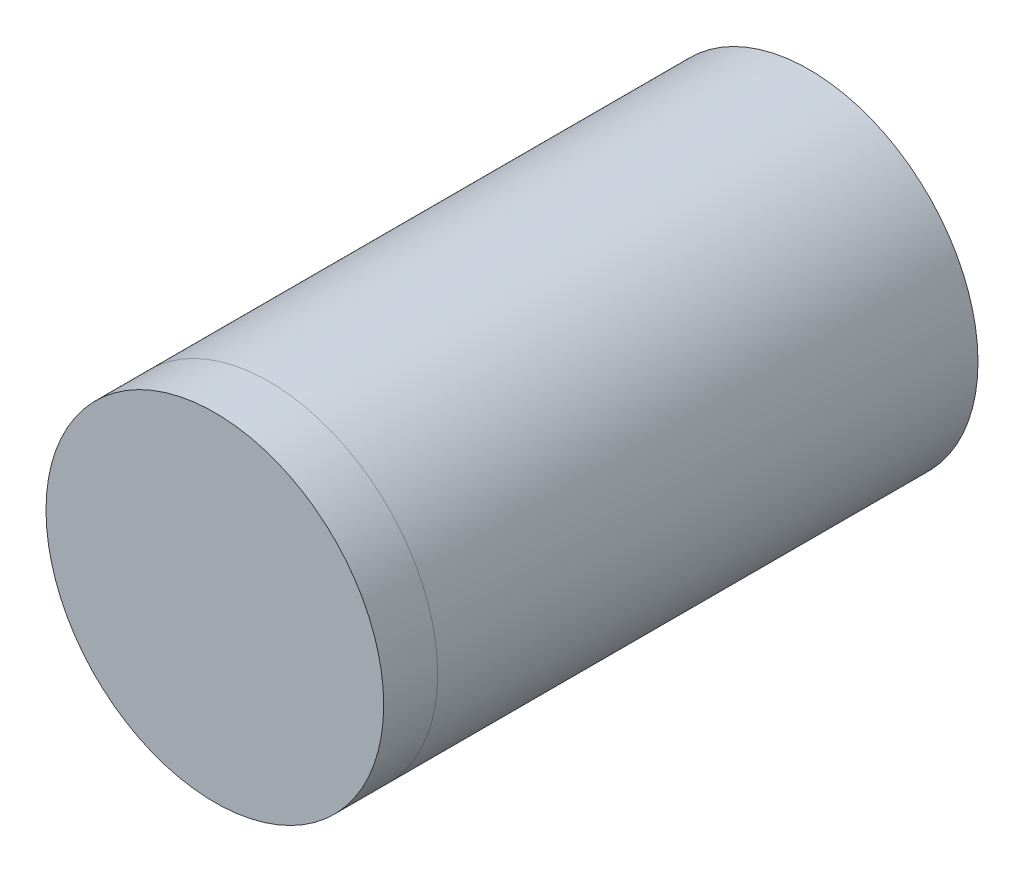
from build123d import *

# Parameters (mm, degrees)
ESQUISSECORPS_W = 10.0005
ESQUISSECORPS_H = 3.2
ESQUISSE1_W     = 10
ESQUISSE1_H     = 32


with BuildPart() as part:
    # EsquisseCorps → Base-R_volution (revolve)
    with BuildSketch(Plane(origin=(0, 0, 0), x_dir=(1, 0, 0), z_dir=(0, 1, 0)), mode=Mode.PRIVATE) as base_r_volution_sk:
        with Locations((5.00025, -33.599)):
            Rectangle(ESQUISSECORPS_W, ESQUISSECORPS_H)
    revolve(base_r_volution_sk.sketch.rotate(Axis((0, 0, 0), (0, 0, 1)), 180), axis=Axis((0, 0, 0), (0, 0, 1)))

    # Esquisse1 → Boss.-R_vol.1 (revolve)
    with BuildSketch(Plane(origin=(0, 0, 0), x_dir=(1, 0, 0), z_dir=(0, 1, 0)), mode=Mode.PRIVATE) as boss_r_vol_1_sk:
        with Locations((5, -15.999)):
            Rectangle(ESQUISSE1_W, ESQUISSE1_H)
    revolve(boss_r_vol_1_sk.sketch.rotate(Axis((0, 0, -0.001), (0, 0, 1)), 180), axis=Axis((0, 0, -0.001), (0, 0, 1)))


solid = part.part
